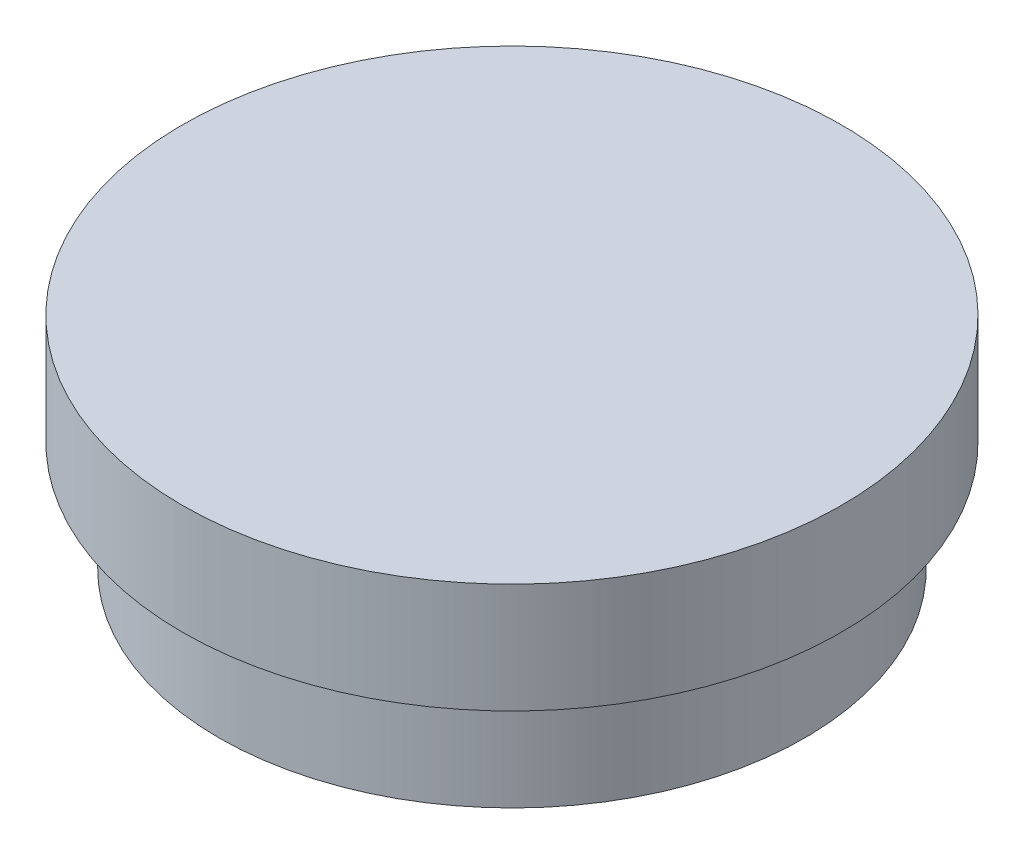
from build123d import *

# Parameters (mm, degrees)
SKETCH1_R       = 80
CASE_MATE_DEPTH = 30
SKETCH2_R       = 90
END_CAP_DEPTH   = 30


with BuildPart() as part:
    # Sketch1 → Case Mate (new body)
    with BuildSketch(Plane(origin=(0, 0, 0), x_dir=(1, 0, 0), z_dir=(0, 1, 0))):
        with Locations(Location((0, 0, 0), (0, 0, 270))):
            Circle(SKETCH1_R)
    extrude(amount=CASE_MATE_DEPTH)

    # Sketch2 → End Cap (add)
    with BuildSketch(Plane(origin=(0, 30, 0), x_dir=(1, 0, 0), z_dir=(0, 1, 0))):
        with Locations(Location((0, 0, 0), (0, 0, 270))):
            Circle(SKETCH2_R)
    extrude(amount=END_CAP_DEPTH)


solid = part.part
